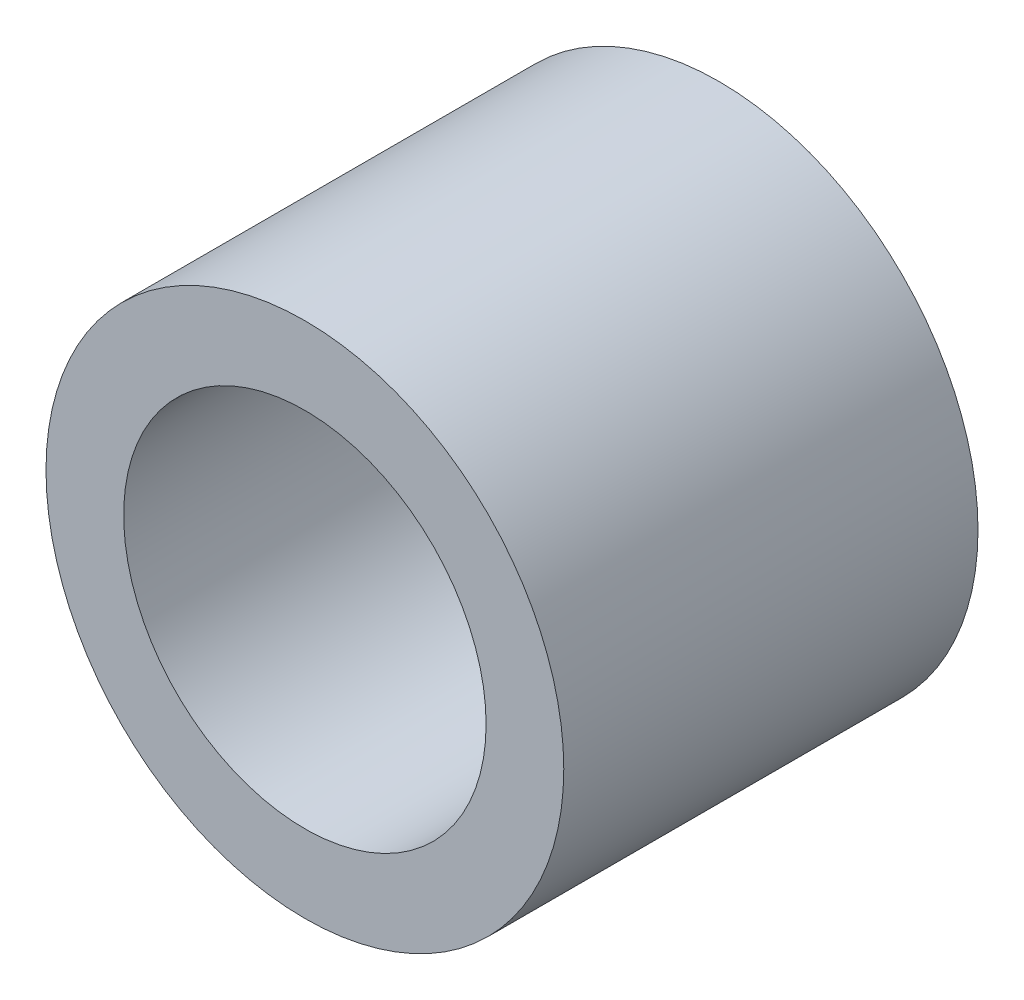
ISO-10303-21;
HEADER;
FILE_DESCRIPTION(('STEP AP214'),'2;1');
FILE_NAME('part.step','',(''),(''),'','','');
FILE_SCHEMA(('AUTOMOTIVE_DESIGN { 1 0 10303 214 1 1 1 1 }'));
ENDSEC;
DATA;
#1=APPLICATION_CONTEXT('core data for automotive mechanical design processes');
#2=APPLICATION_PROTOCOL_DEFINITION('international standard','automotive_design',2000,#1);
#3=PRODUCT_CONTEXT('',#1,'mechanical');
#4=PRODUCT('Part','Part','',(#3));
#5=PRODUCT_RELATED_PRODUCT_CATEGORY('part','',(#4));
#6=PRODUCT_DEFINITION_FORMATION('','',#4);
#7=PRODUCT_DEFINITION_CONTEXT('part definition',#1,'design');
#8=PRODUCT_DEFINITION('design','',#6,#7);
#9=PRODUCT_DEFINITION_SHAPE('','',#8);
#10=(LENGTH_UNIT() NAMED_UNIT(*) SI_UNIT(.MILLI.,.METRE.));
#11=(NAMED_UNIT(*) PLANE_ANGLE_UNIT() SI_UNIT($,.RADIAN.));
#12=(NAMED_UNIT(*) SI_UNIT($,.STERADIAN.) SOLID_ANGLE_UNIT());
#13=UNCERTAINTY_MEASURE_WITH_UNIT(LENGTH_MEASURE(1.E-05),#10,'distance_accuracy_value','');
#14=(GEOMETRIC_REPRESENTATION_CONTEXT(3) GLOBAL_UNCERTAINTY_ASSIGNED_CONTEXT((#13)) GLOBAL_UNIT_ASSIGNED_CONTEXT((#10,
#11,#12)) REPRESENTATION_CONTEXT('',''));
#15=CARTESIAN_POINT('',(0.,0.,0.));
#16=DIRECTION('',(0.,0.,1.));
#17=DIRECTION('',(1.,0.,0.));
#18=AXIS2_PLACEMENT_3D('',#15,#16,#17);
#19=CARTESIAN_POINT('',(0.,0.,4.));
#20=DIRECTION('',(0.,0.,1.));
#21=DIRECTION('',(1.,0.,0.));
#22=AXIS2_PLACEMENT_3D('',#19,#20,#21);
#23=PLANE('',#22);
#24=CARTESIAN_POINT('',(0.,0.,4.));
#25=DIRECTION('',(0.,0.,1.));
#26=DIRECTION('',(1.,0.,0.));
#27=AXIS2_PLACEMENT_3D('',#24,#25,#26);
#28=CIRCLE('',#27,2.5);
#29=CARTESIAN_POINT('',(2.5,0.,4.));
#30=VERTEX_POINT('',#29);
#31=EDGE_CURVE('E10',#30,#30,#28,.T.);
#32=ORIENTED_EDGE('',*,*,#31,.T.);
#33=EDGE_LOOP('',(#32));
#34=FACE_BOUND('',#33,.T.);
#35=CARTESIAN_POINT('',(0.,0.,4.));
#36=DIRECTION('',(0.,0.,1.));
#37=DIRECTION('',(1.,0.,0.));
#38=AXIS2_PLACEMENT_3D('',#35,#36,#37);
#39=CIRCLE('',#38,1.75);
#40=CARTESIAN_POINT('',(1.75,0.,4.));
#41=VERTEX_POINT('',#40);
#42=EDGE_CURVE('E42',#41,#41,#39,.T.);
#43=ORIENTED_EDGE('',*,*,#42,.F.);
#44=EDGE_LOOP('',(#43));
#45=FACE_BOUND('',#44,.T.);
#46=ADVANCED_FACE('F31',(#34,#45),#23,.T.);
#47=CARTESIAN_POINT('',(0.,0.,0.));
#48=DIRECTION('',(0.,0.,1.));
#49=DIRECTION('',(1.,0.,0.));
#50=AXIS2_PLACEMENT_3D('',#47,#48,#49);
#51=PLANE('',#50);
#52=CARTESIAN_POINT('',(0.,0.,0.));
#53=DIRECTION('',(0.,0.,1.));
#54=DIRECTION('',(1.,0.,0.));
#55=AXIS2_PLACEMENT_3D('',#52,#53,#54);
#56=CIRCLE('',#55,2.5);
#57=CARTESIAN_POINT('',(2.5,0.,0.));
#58=VERTEX_POINT('',#57);
#59=EDGE_CURVE('E35',#58,#58,#56,.T.);
#60=ORIENTED_EDGE('',*,*,#59,.F.);
#61=EDGE_LOOP('',(#60));
#62=FACE_BOUND('',#61,.T.);
#63=CARTESIAN_POINT('',(0.,0.,0.));
#64=DIRECTION('',(0.,0.,1.));
#65=DIRECTION('',(1.,0.,0.));
#66=AXIS2_PLACEMENT_3D('',#63,#64,#65);
#67=CIRCLE('',#66,1.75);
#68=CARTESIAN_POINT('',(1.75,0.,0.));
#69=VERTEX_POINT('',#68);
#70=EDGE_CURVE('E44',#69,#69,#67,.T.);
#71=ORIENTED_EDGE('',*,*,#70,.T.);
#72=EDGE_LOOP('',(#71));
#73=FACE_BOUND('',#72,.T.);
#74=ADVANCED_FACE('F54',(#62,#73),#51,.F.);
#75=CARTESIAN_POINT('',(0.,0.,4.));
#76=DIRECTION('',(0.,0.,-1.));
#77=DIRECTION('',(-1.,0.,0.));
#78=AXIS2_PLACEMENT_3D('',#75,#76,#77);
#79=CYLINDRICAL_SURFACE('',#78,2.5);
#80=ORIENTED_EDGE('',*,*,#31,.F.);
#81=EDGE_LOOP('',(#80));
#82=FACE_BOUND('',#81,.T.);
#83=ORIENTED_EDGE('',*,*,#59,.T.);
#84=EDGE_LOOP('',(#83));
#85=FACE_BOUND('',#84,.T.);
#86=ADVANCED_FACE('F33',(#82,#85),#79,.T.);
#87=CARTESIAN_POINT('',(0.,0.,4.));
#88=DIRECTION('',(0.,0.,-1.));
#89=DIRECTION('',(-1.,0.,0.));
#90=AXIS2_PLACEMENT_3D('',#87,#88,#89);
#91=CYLINDRICAL_SURFACE('',#90,1.75);
#92=ORIENTED_EDGE('',*,*,#42,.T.);
#93=EDGE_LOOP('',(#92));
#94=FACE_BOUND('',#93,.T.);
#95=ORIENTED_EDGE('',*,*,#70,.F.);
#96=EDGE_LOOP('',(#95));
#97=FACE_BOUND('',#96,.T.);
#98=ADVANCED_FACE('F50',(#94,#97),#91,.F.);
#99=CLOSED_SHELL('',(#46,#74,#86,#98));
#100=MANIFOLD_SOLID_BREP('B2',#99);
#101=ADVANCED_BREP_SHAPE_REPRESENTATION('',(#18,#100),#14);
#102=SHAPE_DEFINITION_REPRESENTATION(#9,#101);
ENDSEC;
END-ISO-10303-21;
